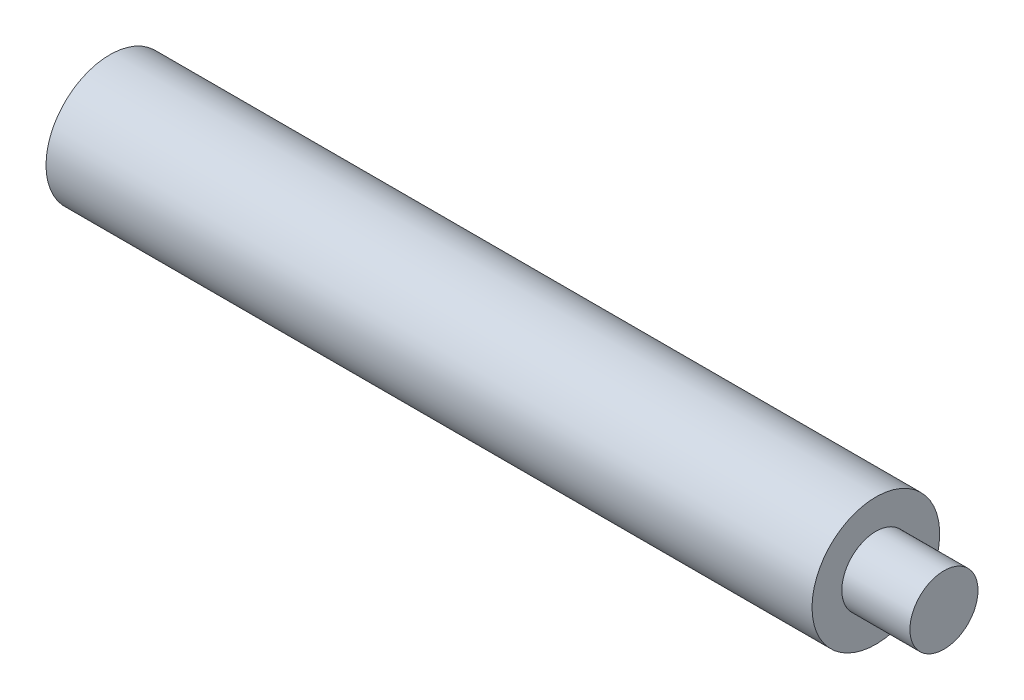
ISO-10303-21;
HEADER;
FILE_DESCRIPTION(('STEP AP214'),'2;1');
FILE_NAME('part.step','',(''),(''),'','','');
FILE_SCHEMA(('AUTOMOTIVE_DESIGN { 1 0 10303 214 1 1 1 1 }'));
ENDSEC;
DATA;
#1=APPLICATION_CONTEXT('core data for automotive mechanical design processes');
#2=APPLICATION_PROTOCOL_DEFINITION('international standard','automotive_design',2000,#1);
#3=PRODUCT_CONTEXT('',#1,'mechanical');
#4=PRODUCT('Part','Part','',(#3));
#5=PRODUCT_RELATED_PRODUCT_CATEGORY('part','',(#4));
#6=PRODUCT_DEFINITION_FORMATION('','',#4);
#7=PRODUCT_DEFINITION_CONTEXT('part definition',#1,'design');
#8=PRODUCT_DEFINITION('design','',#6,#7);
#9=PRODUCT_DEFINITION_SHAPE('','',#8);
#10=(LENGTH_UNIT() NAMED_UNIT(*) SI_UNIT(.MILLI.,.METRE.));
#11=(NAMED_UNIT(*) PLANE_ANGLE_UNIT() SI_UNIT($,.RADIAN.));
#12=(NAMED_UNIT(*) SI_UNIT($,.STERADIAN.) SOLID_ANGLE_UNIT());
#13=UNCERTAINTY_MEASURE_WITH_UNIT(LENGTH_MEASURE(1.E-05),#10,'distance_accuracy_value','');
#14=(GEOMETRIC_REPRESENTATION_CONTEXT(3) GLOBAL_UNCERTAINTY_ASSIGNED_CONTEXT((#13)) GLOBAL_UNIT_ASSIGNED_CONTEXT((#10,
#11,#12)) REPRESENTATION_CONTEXT('',''));
#15=CARTESIAN_POINT('',(0.,0.,0.));
#16=DIRECTION('',(0.,0.,1.));
#17=DIRECTION('',(1.,0.,0.));
#18=AXIS2_PLACEMENT_3D('',#15,#16,#17);
#19=CARTESIAN_POINT('',(98.,0.,0.));
#20=DIRECTION('',(-1.,0.,0.));
#21=DIRECTION('',(0.,0.,1.));
#22=AXIS2_PLACEMENT_3D('',#19,#20,#21);
#23=CYLINDRICAL_SURFACE('',#22,4.);
#24=CARTESIAN_POINT('',(98.,0.,0.));
#25=DIRECTION('',(1.,0.,0.));
#26=DIRECTION('',(0.,0.,-1.));
#27=AXIS2_PLACEMENT_3D('',#24,#25,#26);
#28=CIRCLE('',#27,4.);
#29=CARTESIAN_POINT('',(98.,0.,-4.00000000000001));
#30=VERTEX_POINT('',#29);
#31=EDGE_CURVE('E11',#30,#30,#28,.T.);
#32=ORIENTED_EDGE('',*,*,#31,.F.);
#33=EDGE_LOOP('',(#32));
#34=FACE_BOUND('',#33,.T.);
#35=CARTESIAN_POINT('',(90.,0.,0.));
#36=DIRECTION('',(1.,0.,0.));
#37=DIRECTION('',(0.,0.,-1.));
#38=AXIS2_PLACEMENT_3D('',#35,#36,#37);
#39=CIRCLE('',#38,4.);
#40=CARTESIAN_POINT('',(90.,0.,-4.00000000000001));
#41=VERTEX_POINT('',#40);
#42=EDGE_CURVE('E55',#41,#41,#39,.T.);
#43=ORIENTED_EDGE('',*,*,#42,.T.);
#44=EDGE_LOOP('',(#43));
#45=FACE_BOUND('',#44,.T.);
#46=ADVANCED_FACE('F52',(#34,#45),#23,.T.);
#47=CARTESIAN_POINT('',(98.,0.,0.));
#48=DIRECTION('',(1.,0.,0.));
#49=DIRECTION('',(0.,0.,-1.));
#50=AXIS2_PLACEMENT_3D('',#47,#48,#49);
#51=PLANE('',#50);
#52=ORIENTED_EDGE('',*,*,#31,.T.);
#53=EDGE_LOOP('',(#52));
#54=FACE_BOUND('',#53,.T.);
#55=ADVANCED_FACE('F73',(#54),#51,.T.);
#56=CARTESIAN_POINT('',(90.,0.,0.));
#57=DIRECTION('',(1.,0.,0.));
#58=DIRECTION('',(0.,0.,-1.));
#59=AXIS2_PLACEMENT_3D('',#56,#57,#58);
#60=PLANE('',#59);
#61=ORIENTED_EDGE('',*,*,#42,.F.);
#62=EDGE_LOOP('',(#61));
#63=FACE_BOUND('',#62,.T.);
#64=ADVANCED_FACE('F71',(#63),#60,.F.);
#65=CLOSED_SHELL('',(#46,#55,#64));
#66=MANIFOLD_SOLID_BREP('B2',#65);
#67=CARTESIAN_POINT('',(90.,0.,0.));
#68=DIRECTION('',(1.,0.,0.));
#69=DIRECTION('',(0.,0.,-1.));
#70=AXIS2_PLACEMENT_3D('',#67,#68,#69);
#71=PLANE('',#70);
#72=CARTESIAN_POINT('',(90.,0.,0.));
#73=DIRECTION('',(1.,0.,0.));
#74=DIRECTION('',(0.,0.,-1.));
#75=AXIS2_PLACEMENT_3D('',#72,#73,#74);
#76=CIRCLE('',#75,7.5);
#77=CARTESIAN_POINT('',(90.,0.,7.50000000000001));
#78=VERTEX_POINT('',#77);
#79=EDGE_CURVE('E51',#78,#78,#76,.T.);
#80=ORIENTED_EDGE('',*,*,#79,.T.);
#81=EDGE_LOOP('',(#80));
#82=FACE_BOUND('',#81,.T.);
#83=CARTESIAN_POINT('',(90.,0.,0.));
#84=DIRECTION('',(1.,0.,0.));
#85=DIRECTION('',(0.,0.,-1.));
#86=AXIS2_PLACEMENT_3D('',#83,#84,#85);
#87=CIRCLE('',#86,4.);
#88=CARTESIAN_POINT('',(90.,0.,4.00000000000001));
#89=VERTEX_POINT('',#88);
#90=EDGE_CURVE('E122',#89,#89,#87,.T.);
#91=ORIENTED_EDGE('',*,*,#90,.F.);
#92=EDGE_LOOP('',(#91));
#93=FACE_BOUND('',#92,.T.);
#94=ADVANCED_FACE('F107',(#82,#93),#71,.T.);
#95=CARTESIAN_POINT('',(0.,0.,0.));
#96=DIRECTION('',(1.,0.,0.));
#97=DIRECTION('',(0.,0.,-1.));
#98=AXIS2_PLACEMENT_3D('',#95,#96,#97);
#99=PLANE('',#98);
#100=CARTESIAN_POINT('',(0.,0.,0.));
#101=DIRECTION('',(1.,0.,0.));
#102=DIRECTION('',(0.,0.,-1.));
#103=AXIS2_PLACEMENT_3D('',#100,#101,#102);
#104=CIRCLE('',#103,7.5);
#105=CARTESIAN_POINT('',(0.,0.,7.50000000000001));
#106=VERTEX_POINT('',#105);
#107=EDGE_CURVE('E111',#106,#106,#104,.T.);
#108=ORIENTED_EDGE('',*,*,#107,.F.);
#109=EDGE_LOOP('',(#108));
#110=FACE_BOUND('',#109,.T.);
#111=CARTESIAN_POINT('',(0.,0.,0.));
#112=DIRECTION('',(1.,0.,0.));
#113=DIRECTION('',(0.,0.,-1.));
#114=AXIS2_PLACEMENT_3D('',#111,#112,#113);
#115=CIRCLE('',#114,4.);
#116=CARTESIAN_POINT('',(0.,0.,4.00000000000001));
#117=VERTEX_POINT('',#116);
#118=EDGE_CURVE('E124',#117,#117,#115,.T.);
#119=ORIENTED_EDGE('',*,*,#118,.T.);
#120=EDGE_LOOP('',(#119));
#121=FACE_BOUND('',#120,.T.);
#122=ADVANCED_FACE('F138',(#110,#121),#99,.F.);
#123=CARTESIAN_POINT('',(90.,0.,0.));
#124=DIRECTION('',(-1.,0.,0.));
#125=DIRECTION('',(0.,0.,1.));
#126=AXIS2_PLACEMENT_3D('',#123,#124,#125);
#127=CYLINDRICAL_SURFACE('',#126,7.5);
#128=CARTESIAN_POINT('',(90.,0.,7.50000000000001));
#129=CARTESIAN_POINT('',(89.0625,0.,7.50000000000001));
#130=CARTESIAN_POINT('',(88.125,0.,7.50000000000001));
#131=CARTESIAN_POINT('',(86.25,0.,7.50000000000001));
#132=CARTESIAN_POINT('',(85.3125,0.,7.50000000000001));
#133=CARTESIAN_POINT('',(83.4375,0.,7.50000000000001));
#134=CARTESIAN_POINT('',(82.5,0.,7.50000000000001));
#135=CARTESIAN_POINT('',(80.625,0.,7.50000000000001));
#136=CARTESIAN_POINT('',(79.6875,0.,7.50000000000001));
#137=CARTESIAN_POINT('',(77.8125,0.,7.50000000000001));
#138=CARTESIAN_POINT('',(76.875,0.,7.50000000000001));
#139=CARTESIAN_POINT('',(75.,0.,7.50000000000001));
#140=CARTESIAN_POINT('',(74.0625,0.,7.50000000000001));
#141=CARTESIAN_POINT('',(72.1875,0.,7.50000000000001));
#142=CARTESIAN_POINT('',(71.25,0.,7.50000000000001));
#143=CARTESIAN_POINT('',(69.375,0.,7.50000000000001));
#144=CARTESIAN_POINT('',(68.4375,0.,7.50000000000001));
#145=CARTESIAN_POINT('',(66.5625,0.,7.50000000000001));
#146=CARTESIAN_POINT('',(65.625,0.,7.50000000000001));
#147=CARTESIAN_POINT('',(63.75,0.,7.50000000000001));
#148=CARTESIAN_POINT('',(62.8125,0.,7.50000000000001));
#149=CARTESIAN_POINT('',(60.9375,0.,7.50000000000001));
#150=CARTESIAN_POINT('',(60.,0.,7.50000000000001));
#151=CARTESIAN_POINT('',(58.125,0.,7.50000000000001));
#152=CARTESIAN_POINT('',(57.1875,0.,7.50000000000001));
#153=CARTESIAN_POINT('',(55.3125,0.,7.50000000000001));
#154=CARTESIAN_POINT('',(54.375,0.,7.50000000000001));
#155=CARTESIAN_POINT('',(52.5,0.,7.50000000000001));
#156=CARTESIAN_POINT('',(51.5625,0.,7.50000000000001));
#157=CARTESIAN_POINT('',(49.6875,0.,7.50000000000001));
#158=CARTESIAN_POINT('',(48.75,0.,7.50000000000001));
#159=CARTESIAN_POINT('',(46.875,0.,7.50000000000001));
#160=CARTESIAN_POINT('',(45.9375,0.,7.50000000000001));
#161=CARTESIAN_POINT('',(44.0625,0.,7.50000000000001));
#162=CARTESIAN_POINT('',(43.125,0.,7.50000000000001));
#163=CARTESIAN_POINT('',(41.25,0.,7.50000000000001));
#164=CARTESIAN_POINT('',(40.3125,0.,7.50000000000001));
#165=CARTESIAN_POINT('',(38.4375,0.,7.50000000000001));
#166=CARTESIAN_POINT('',(37.5,0.,7.50000000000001));
#167=CARTESIAN_POINT('',(35.625,0.,7.50000000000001));
#168=CARTESIAN_POINT('',(34.6875,0.,7.50000000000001));
#169=CARTESIAN_POINT('',(32.8125,0.,7.50000000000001));
#170=CARTESIAN_POINT('',(31.875,0.,7.50000000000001));
#171=CARTESIAN_POINT('',(30.,0.,7.50000000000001));
#172=CARTESIAN_POINT('',(29.0625,0.,7.50000000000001));
#173=CARTESIAN_POINT('',(27.1875,0.,7.50000000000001));
#174=CARTESIAN_POINT('',(26.25,0.,7.50000000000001));
#175=CARTESIAN_POINT('',(24.375,0.,7.50000000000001));
#176=CARTESIAN_POINT('',(23.4375,0.,7.50000000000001));
#177=CARTESIAN_POINT('',(21.5625,0.,7.50000000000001));
#178=CARTESIAN_POINT('',(20.625,0.,7.50000000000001));
#179=CARTESIAN_POINT('',(18.75,0.,7.50000000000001));
#180=CARTESIAN_POINT('',(17.8125,0.,7.50000000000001));
#181=CARTESIAN_POINT('',(15.9375,0.,7.50000000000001));
#182=CARTESIAN_POINT('',(15.,0.,7.50000000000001));
#183=CARTESIAN_POINT('',(13.125,0.,7.50000000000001));
#184=CARTESIAN_POINT('',(12.1875,0.,7.50000000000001));
#185=CARTESIAN_POINT('',(10.3125,0.,7.50000000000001));
#186=CARTESIAN_POINT('',(9.37499999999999,0.,7.50000000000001));
#187=CARTESIAN_POINT('',(7.49999999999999,0.,7.50000000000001));
#188=CARTESIAN_POINT('',(6.56249999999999,0.,7.50000000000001));
#189=CARTESIAN_POINT('',(4.68749999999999,0.,7.50000000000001));
#190=CARTESIAN_POINT('',(3.74999999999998,0.,7.50000000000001));
#191=CARTESIAN_POINT('',(1.87499999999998,0.,7.50000000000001));
#192=CARTESIAN_POINT('',(0.937499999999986,0.,7.50000000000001));
#193=CARTESIAN_POINT('',(0.,0.,7.50000000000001));
#194=B_SPLINE_CURVE_WITH_KNOTS('',3,(#128,#129,#130,#131,#132,#133,#134,#135,#136,#137,#138,
#139,#140,#141,#142,#143,#144,#145,#146,#147,#148,#149,#150,#151,#152,#153,#154,#155,#156,#157,
#158,#159,#160,#161,#162,#163,#164,#165,#166,#167,#168,#169,#170,#171,#172,#173,#174,#175,#176,
#177,#178,#179,#180,#181,#182,#183,#184,#185,#186,#187,#188,#189,#190,#191,#192,#193),
.UNSPECIFIED.,.F.,.F.,(4,2,2,2,2,2,2,2,2,2,2,2,2,2,2,2,2,2,2,2,2,2,2,2,2,2,2,2,2,2,2,2,4),(0.,
2.8125,5.62499999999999,8.43749999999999,11.25,14.0625,16.875,19.6875,22.5,25.3125,28.125,
30.9375,33.75,36.5625,39.375,42.1875,45.,47.8125,50.625,53.4375,56.25,59.0625,61.875,64.6875,
67.5,70.3125,73.125,75.9375,78.75,81.5625,84.375,87.1875,90.),.UNSPECIFIED.);
#195=EDGE_CURVE('BSEAM109',#78,#106,#194,.T.);
#196=ORIENTED_EDGE('',*,*,#79,.F.);
#197=ORIENTED_EDGE('',*,*,#107,.T.);
#198=ORIENTED_EDGE('',*,*,#195,.T.);
#199=ORIENTED_EDGE('',*,*,#195,.F.);
#200=EDGE_LOOP('',(#196,#198,#197,#199));
#201=FACE_BOUND('',#200,.T.);
#202=ADVANCED_FACE('F109',(#201),#127,.T.);
#203=CARTESIAN_POINT('',(90.,0.,0.));
#204=DIRECTION('',(-1.,0.,0.));
#205=DIRECTION('',(0.,0.,1.));
#206=AXIS2_PLACEMENT_3D('',#203,#204,#205);
#207=CYLINDRICAL_SURFACE('',#206,4.);
#208=CARTESIAN_POINT('',(90.,0.,4.00000000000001));
#209=CARTESIAN_POINT('',(89.0625,0.,4.00000000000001));
#210=CARTESIAN_POINT('',(88.125,0.,4.00000000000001));
#211=CARTESIAN_POINT('',(86.25,0.,4.00000000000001));
#212=CARTESIAN_POINT('',(85.3125,0.,4.00000000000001));
#213=CARTESIAN_POINT('',(83.4375,0.,4.00000000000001));
#214=CARTESIAN_POINT('',(82.5,0.,4.00000000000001));
#215=CARTESIAN_POINT('',(80.625,0.,4.00000000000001));
#216=CARTESIAN_POINT('',(79.6875,0.,4.00000000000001));
#217=CARTESIAN_POINT('',(77.8125,0.,4.00000000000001));
#218=CARTESIAN_POINT('',(76.875,0.,4.00000000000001));
#219=CARTESIAN_POINT('',(75.,0.,4.00000000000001));
#220=CARTESIAN_POINT('',(74.0625,0.,4.00000000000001));
#221=CARTESIAN_POINT('',(72.1875,0.,4.00000000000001));
#222=CARTESIAN_POINT('',(71.25,0.,4.00000000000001));
#223=CARTESIAN_POINT('',(69.375,0.,4.00000000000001));
#224=CARTESIAN_POINT('',(68.4375,0.,4.00000000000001));
#225=CARTESIAN_POINT('',(66.5625,0.,4.00000000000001));
#226=CARTESIAN_POINT('',(65.625,0.,4.00000000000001));
#227=CARTESIAN_POINT('',(63.75,0.,4.00000000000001));
#228=CARTESIAN_POINT('',(62.8125,0.,4.00000000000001));
#229=CARTESIAN_POINT('',(60.9375,0.,4.00000000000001));
#230=CARTESIAN_POINT('',(60.,0.,4.00000000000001));
#231=CARTESIAN_POINT('',(58.125,0.,4.00000000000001));
#232=CARTESIAN_POINT('',(57.1875,0.,4.00000000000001));
#233=CARTESIAN_POINT('',(55.3125,0.,4.00000000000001));
#234=CARTESIAN_POINT('',(54.375,0.,4.00000000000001));
#235=CARTESIAN_POINT('',(52.5,0.,4.00000000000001));
#236=CARTESIAN_POINT('',(51.5625,0.,4.00000000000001));
#237=CARTESIAN_POINT('',(49.6875,0.,4.00000000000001));
#238=CARTESIAN_POINT('',(48.75,0.,4.00000000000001));
#239=CARTESIAN_POINT('',(46.875,0.,4.00000000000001));
#240=CARTESIAN_POINT('',(45.9375,0.,4.00000000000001));
#241=CARTESIAN_POINT('',(44.0625,0.,4.00000000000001));
#242=CARTESIAN_POINT('',(43.125,0.,4.00000000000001));
#243=CARTESIAN_POINT('',(41.25,0.,4.00000000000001));
#244=CARTESIAN_POINT('',(40.3125,0.,4.00000000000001));
#245=CARTESIAN_POINT('',(38.4375,0.,4.00000000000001));
#246=CARTESIAN_POINT('',(37.5,0.,4.00000000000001));
#247=CARTESIAN_POINT('',(35.625,0.,4.00000000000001));
#248=CARTESIAN_POINT('',(34.6875,0.,4.00000000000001));
#249=CARTESIAN_POINT('',(32.8125,0.,4.00000000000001));
#250=CARTESIAN_POINT('',(31.875,0.,4.00000000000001));
#251=CARTESIAN_POINT('',(30.,0.,4.00000000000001));
#252=CARTESIAN_POINT('',(29.0625,0.,4.00000000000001));
#253=CARTESIAN_POINT('',(27.1875,0.,4.00000000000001));
#254=CARTESIAN_POINT('',(26.25,0.,4.00000000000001));
#255=CARTESIAN_POINT('',(24.375,0.,4.00000000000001));
#256=CARTESIAN_POINT('',(23.4375,0.,4.00000000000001));
#257=CARTESIAN_POINT('',(21.5625,0.,4.00000000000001));
#258=CARTESIAN_POINT('',(20.625,0.,4.00000000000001));
#259=CARTESIAN_POINT('',(18.75,0.,4.00000000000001));
#260=CARTESIAN_POINT('',(17.8125,0.,4.00000000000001));
#261=CARTESIAN_POINT('',(15.9375,0.,4.00000000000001));
#262=CARTESIAN_POINT('',(15.,0.,4.00000000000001));
#263=CARTESIAN_POINT('',(13.125,0.,4.00000000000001));
#264=CARTESIAN_POINT('',(12.1875,0.,4.00000000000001));
#265=CARTESIAN_POINT('',(10.3125,0.,4.00000000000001));
#266=CARTESIAN_POINT('',(9.37499999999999,0.,4.00000000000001));
#267=CARTESIAN_POINT('',(7.49999999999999,0.,4.00000000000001));
#268=CARTESIAN_POINT('',(6.56249999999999,0.,4.00000000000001));
#269=CARTESIAN_POINT('',(4.68749999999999,0.,4.00000000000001));
#270=CARTESIAN_POINT('',(3.74999999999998,0.,4.00000000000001));
#271=CARTESIAN_POINT('',(1.87499999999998,0.,4.00000000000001));
#272=CARTESIAN_POINT('',(0.937499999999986,0.,4.00000000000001));
#273=CARTESIAN_POINT('',(0.,0.,4.00000000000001));
#274=B_SPLINE_CURVE_WITH_KNOTS('',3,(#208,#209,#210,#211,#212,#213,#214,#215,#216,#217,#218,
#219,#220,#221,#222,#223,#224,#225,#226,#227,#228,#229,#230,#231,#232,#233,#234,#235,#236,#237,
#238,#239,#240,#241,#242,#243,#244,#245,#246,#247,#248,#249,#250,#251,#252,#253,#254,#255,#256,
#257,#258,#259,#260,#261,#262,#263,#264,#265,#266,#267,#268,#269,#270,#271,#272,#273),
.UNSPECIFIED.,.F.,.F.,(4,2,2,2,2,2,2,2,2,2,2,2,2,2,2,2,2,2,2,2,2,2,2,2,2,2,2,2,2,2,2,2,4),(0.,
2.8125,5.62499999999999,8.43749999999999,11.25,14.0625,16.875,19.6875,22.5,25.3125,28.125,
30.9375,33.75,36.5625,39.375,42.1875,45.,47.8125,50.625,53.4375,56.25,59.0625,61.875,64.6875,
67.5,70.3125,73.125,75.9375,78.75,81.5625,84.375,87.1875,90.),.UNSPECIFIED.);
#275=EDGE_CURVE('BSEAM134',#89,#117,#274,.T.);
#276=ORIENTED_EDGE('',*,*,#90,.T.);
#277=ORIENTED_EDGE('',*,*,#118,.F.);
#278=ORIENTED_EDGE('',*,*,#275,.T.);
#279=ORIENTED_EDGE('',*,*,#275,.F.);
#280=EDGE_LOOP('',(#276,#278,#277,#279));
#281=FACE_BOUND('',#280,.T.);
#282=ADVANCED_FACE('F134',(#281),#207,.F.);
#283=CLOSED_SHELL('',(#94,#122,#202,#282));
#284=MANIFOLD_SOLID_BREP('B6',#283);
#285=ADVANCED_BREP_SHAPE_REPRESENTATION('',(#18,#66,#284),#14);
#286=SHAPE_DEFINITION_REPRESENTATION(#9,#285);
ENDSEC;
END-ISO-10303-21;
